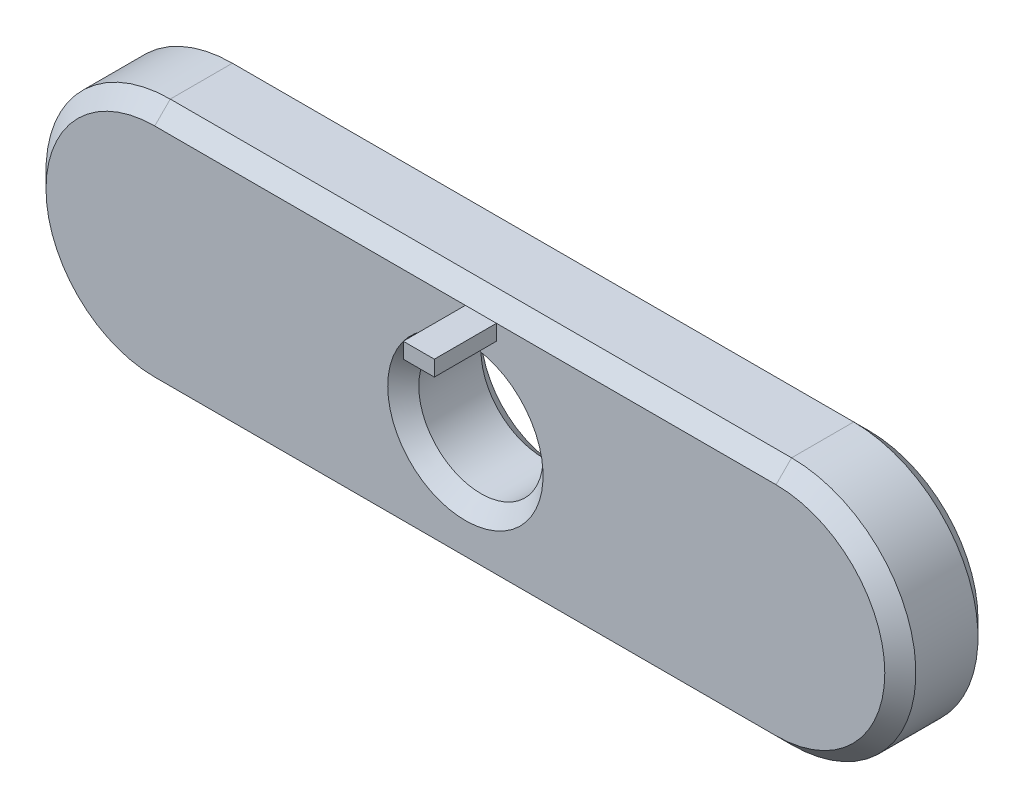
ISO-10303-21;
HEADER;
FILE_DESCRIPTION(('STEP AP214'),'2;1');
FILE_NAME('part.step','',(''),(''),'','','');
FILE_SCHEMA(('AUTOMOTIVE_DESIGN { 1 0 10303 214 1 1 1 1 }'));
ENDSEC;
DATA;
#1=APPLICATION_CONTEXT('core data for automotive mechanical design processes');
#2=APPLICATION_PROTOCOL_DEFINITION('international standard','automotive_design',2000,#1);
#3=PRODUCT_CONTEXT('',#1,'mechanical');
#4=PRODUCT('Part','Part','',(#3));
#5=PRODUCT_RELATED_PRODUCT_CATEGORY('part','',(#4));
#6=PRODUCT_DEFINITION_FORMATION('','',#4);
#7=PRODUCT_DEFINITION_CONTEXT('part definition',#1,'design');
#8=PRODUCT_DEFINITION('design','',#6,#7);
#9=PRODUCT_DEFINITION_SHAPE('','',#8);
#10=(LENGTH_UNIT() NAMED_UNIT(*) SI_UNIT(.MILLI.,.METRE.));
#11=(NAMED_UNIT(*) PLANE_ANGLE_UNIT() SI_UNIT($,.RADIAN.));
#12=(NAMED_UNIT(*) SI_UNIT($,.STERADIAN.) SOLID_ANGLE_UNIT());
#13=UNCERTAINTY_MEASURE_WITH_UNIT(LENGTH_MEASURE(1.E-05),#10,'distance_accuracy_value','');
#14=(GEOMETRIC_REPRESENTATION_CONTEXT(3) GLOBAL_UNCERTAINTY_ASSIGNED_CONTEXT((#13)) GLOBAL_UNIT_ASSIGNED_CONTEXT((#10,
#11,#12)) REPRESENTATION_CONTEXT('',''));
#15=CARTESIAN_POINT('',(0.,0.,0.));
#16=DIRECTION('',(0.,0.,1.));
#17=DIRECTION('',(1.,0.,0.));
#18=AXIS2_PLACEMENT_3D('',#15,#16,#17);
#19=CARTESIAN_POINT('',(10.,0.,3.));
#20=DIRECTION('',(0.,0.,-1.));
#21=DIRECTION('',(-1.,0.,0.));
#22=AXIS2_PLACEMENT_3D('',#19,#20,#21);
#23=PLANE('',#22);
#24=CARTESIAN_POINT('',(0.,0.,3.));
#25=DIRECTION('',(0.,0.,-1.));
#26=DIRECTION('',(-1.,0.,0.));
#27=AXIS2_PLACEMENT_3D('',#24,#25,#26);
#28=CIRCLE('',#27,2.5);
#29=CARTESIAN_POINT('',(-2.5,0.,3.));
#30=VERTEX_POINT('',#29);
#31=EDGE_CURVE('E179',#30,#30,#28,.T.);
#32=ORIENTED_EDGE('',*,*,#31,.T.);
#33=EDGE_LOOP('',(#32));
#34=FACE_BOUND('',#33,.T.);
#35=DIRECTION('',(0.,-1.,0.));
#36=VECTOR('',#35,1.);
#37=CARTESIAN_POINT('',(0.,0.,3.));
#38=LINE('',#37,#36);
#39=CARTESIAN_POINT('',(0.,3.49999999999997,3.00000000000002));
#40=VERTEX_POINT('',#39);
#41=CARTESIAN_POINT('',(0.,3.,3.));
#42=VERTEX_POINT('',#41);
#43=EDGE_CURVE('E143',#40,#42,#38,.T.);
#44=ORIENTED_EDGE('',*,*,#43,.F.);
#45=DIRECTION('',(-1.,0.,0.));
#46=VECTOR('',#45,1.);
#47=CARTESIAN_POINT('',(-10.,3.5,3.));
#48=LINE('',#47,#46);
#49=CARTESIAN_POINT('',(-10.,3.5,3.));
#50=VERTEX_POINT('',#49);
#51=EDGE_CURVE('E192',#40,#50,#48,.T.);
#52=ORIENTED_EDGE('',*,*,#51,.T.);
#53=CARTESIAN_POINT('',(-10.,0.,3.));
#54=DIRECTION('',(0.,0.,-1.));
#55=DIRECTION('',(-1.,0.,0.));
#56=AXIS2_PLACEMENT_3D('',#53,#54,#55);
#57=CIRCLE('',#56,3.49999999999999);
#58=CARTESIAN_POINT('',(-10.,-3.49999999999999,3.));
#59=VERTEX_POINT('',#58);
#60=EDGE_CURVE('E195',#50,#59,#57,.F.);
#61=ORIENTED_EDGE('',*,*,#60,.T.);
#62=DIRECTION('',(1.,0.,0.));
#63=VECTOR('',#62,1.);
#64=CARTESIAN_POINT('',(10.,-3.49999999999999,3.));
#65=LINE('',#64,#63);
#66=CARTESIAN_POINT('',(10.,-3.5,3.));
#67=VERTEX_POINT('',#66);
#68=EDGE_CURVE('E197',#59,#67,#65,.T.);
#69=ORIENTED_EDGE('',*,*,#68,.T.);
#70=CARTESIAN_POINT('',(10.,0.,3.));
#71=DIRECTION('',(0.,0.,-1.));
#72=DIRECTION('',(-1.,0.,0.));
#73=AXIS2_PLACEMENT_3D('',#70,#71,#72);
#74=CIRCLE('',#73,3.5);
#75=CARTESIAN_POINT('',(10.,3.5,3.));
#76=VERTEX_POINT('',#75);
#77=EDGE_CURVE('E190',#67,#76,#74,.F.);
#78=ORIENTED_EDGE('',*,*,#77,.T.);
#79=CARTESIAN_POINT('',(1.,3.5,3.));
#80=VERTEX_POINT('',#79);
#81=EDGE_CURVE('E193',#76,#80,#48,.T.);
#82=ORIENTED_EDGE('',*,*,#81,.T.);
#83=DIRECTION('',(0.,1.,0.));
#84=VECTOR('',#83,1.);
#85=CARTESIAN_POINT('',(1.,0.,3.));
#86=LINE('',#85,#84);
#87=CARTESIAN_POINT('',(1.,3.,3.));
#88=VERTEX_POINT('',#87);
#89=EDGE_CURVE('E53',#88,#80,#86,.T.);
#90=ORIENTED_EDGE('',*,*,#89,.F.);
#91=DIRECTION('',(1.,0.,0.));
#92=VECTOR('',#91,1.);
#93=CARTESIAN_POINT('',(10.,3.,3.));
#94=LINE('',#93,#92);
#95=EDGE_CURVE('E48',#42,#88,#94,.T.);
#96=ORIENTED_EDGE('',*,*,#95,.F.);
#97=EDGE_LOOP('',(#44,#52,#61,#69,#78,#82,#90,#96));
#98=FACE_BOUND('',#97,.T.);
#99=ADVANCED_FACE('F33',(#34,#98),#23,.F.);
#100=CARTESIAN_POINT('',(10.,0.,3.));
#101=DIRECTION('',(0.,0.,-1.));
#102=DIRECTION('',(-1.,0.,0.));
#103=AXIS2_PLACEMENT_3D('',#100,#101,#102);
#104=CYLINDRICAL_SURFACE('',#103,4.);
#105=DIRECTION('',(0.,0.,-1.));
#106=VECTOR('',#105,1.);
#107=CARTESIAN_POINT('',(10.,4.,3.));
#108=LINE('',#107,#106);
#109=CARTESIAN_POINT('',(10.,4.,2.49999999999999));
#110=VERTEX_POINT('',#109);
#111=CARTESIAN_POINT('',(10.,4.,0.500000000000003));
#112=VERTEX_POINT('',#111);
#113=EDGE_CURVE('E176',#110,#112,#108,.T.);
#114=ORIENTED_EDGE('',*,*,#113,.F.);
#115=CARTESIAN_POINT('',(10.,0.,2.49999999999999));
#116=DIRECTION('',(0.,0.,-1.));
#117=DIRECTION('',(-1.,0.,0.));
#118=AXIS2_PLACEMENT_3D('',#115,#116,#117);
#119=CIRCLE('',#118,4.);
#120=CARTESIAN_POINT('',(10.,-4.,2.49999999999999));
#121=VERTEX_POINT('',#120);
#122=EDGE_CURVE('E216',#110,#121,#119,.T.);
#123=ORIENTED_EDGE('',*,*,#122,.T.);
#124=DIRECTION('',(0.,0.,-1.));
#125=VECTOR('',#124,1.);
#126=CARTESIAN_POINT('',(10.,-4.,3.));
#127=LINE('',#126,#125);
#128=CARTESIAN_POINT('',(10.,-4.,0.500000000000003));
#129=VERTEX_POINT('',#128);
#130=EDGE_CURVE('E175',#121,#129,#127,.T.);
#131=ORIENTED_EDGE('',*,*,#130,.T.);
#132=CARTESIAN_POINT('',(10.,0.,0.500000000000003));
#133=DIRECTION('',(0.,0.,-1.));
#134=DIRECTION('',(-1.,0.,0.));
#135=AXIS2_PLACEMENT_3D('',#132,#133,#134);
#136=CIRCLE('',#135,4.);
#137=EDGE_CURVE('E214',#129,#112,#136,.F.);
#138=ORIENTED_EDGE('',*,*,#137,.T.);
#139=EDGE_LOOP('',(#114,#123,#131,#138));
#140=FACE_BOUND('',#139,.T.);
#141=ADVANCED_FACE('F35',(#140),#104,.T.);
#142=CARTESIAN_POINT('',(-10.,4.,3.));
#143=DIRECTION('',(0.,1.,0.));
#144=DIRECTION('',(0.,0.,1.));
#145=AXIS2_PLACEMENT_3D('',#142,#143,#144);
#146=PLANE('',#145);
#147=DIRECTION('',(0.,0.,-1.));
#148=VECTOR('',#147,1.);
#149=CARTESIAN_POINT('',(-10.,4.,3.));
#150=LINE('',#149,#148);
#151=CARTESIAN_POINT('',(-10.,4.,2.49999999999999));
#152=VERTEX_POINT('',#151);
#153=CARTESIAN_POINT('',(-10.,4.,0.500000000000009));
#154=VERTEX_POINT('',#153);
#155=EDGE_CURVE('E180',#152,#154,#150,.T.);
#156=ORIENTED_EDGE('',*,*,#155,.F.);
#157=DIRECTION('',(1.,0.,0.));
#158=VECTOR('',#157,1.);
#159=CARTESIAN_POINT('',(10.,4.,2.49999999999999));
#160=LINE('',#159,#158);
#161=EDGE_CURVE('E212',#152,#110,#160,.T.);
#162=ORIENTED_EDGE('',*,*,#161,.T.);
#163=ORIENTED_EDGE('',*,*,#113,.T.);
#164=DIRECTION('',(-1.,0.,0.));
#165=VECTOR('',#164,1.);
#166=CARTESIAN_POINT('',(-10.,4.,0.500000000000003));
#167=LINE('',#166,#165);
#168=EDGE_CURVE('E209',#112,#154,#167,.T.);
#169=ORIENTED_EDGE('',*,*,#168,.T.);
#170=EDGE_LOOP('',(#156,#162,#163,#169));
#171=FACE_BOUND('',#170,.T.);
#172=ADVANCED_FACE('F276',(#171),#146,.T.);
#173=CARTESIAN_POINT('',(-10.,0.,3.));
#174=DIRECTION('',(0.,0.,-1.));
#175=DIRECTION('',(-1.,0.,0.));
#176=AXIS2_PLACEMENT_3D('',#173,#174,#175);
#177=CYLINDRICAL_SURFACE('',#176,4.);
#178=DIRECTION('',(0.,0.,-1.));
#179=VECTOR('',#178,1.);
#180=CARTESIAN_POINT('',(-10.,-4.,3.));
#181=LINE('',#180,#179);
#182=CARTESIAN_POINT('',(-10.,-4.,2.5));
#183=VERTEX_POINT('',#182);
#184=CARTESIAN_POINT('',(-10.,-4.,0.500000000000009));
#185=VERTEX_POINT('',#184);
#186=EDGE_CURVE('E183',#183,#185,#181,.T.);
#187=ORIENTED_EDGE('',*,*,#186,.F.);
#188=CARTESIAN_POINT('',(-10.,0.,2.5));
#189=DIRECTION('',(0.,0.,-1.));
#190=DIRECTION('',(-1.,0.,0.));
#191=AXIS2_PLACEMENT_3D('',#188,#189,#190);
#192=CIRCLE('',#191,4.);
#193=EDGE_CURVE('E207',#183,#152,#192,.T.);
#194=ORIENTED_EDGE('',*,*,#193,.T.);
#195=ORIENTED_EDGE('',*,*,#155,.T.);
#196=CARTESIAN_POINT('',(-10.,0.,0.500000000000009));
#197=DIRECTION('',(0.,0.,-1.));
#198=DIRECTION('',(-1.,0.,0.));
#199=AXIS2_PLACEMENT_3D('',#196,#197,#198);
#200=CIRCLE('',#199,4.);
#201=EDGE_CURVE('E205',#154,#185,#200,.F.);
#202=ORIENTED_EDGE('',*,*,#201,.T.);
#203=EDGE_LOOP('',(#187,#194,#195,#202));
#204=FACE_BOUND('',#203,.T.);
#205=ADVANCED_FACE('F272',(#204),#177,.T.);
#206=CARTESIAN_POINT('',(-10.,-4.,3.));
#207=DIRECTION('',(0.,1.,0.));
#208=DIRECTION('',(-1.,0.,0.));
#209=AXIS2_PLACEMENT_3D('',#206,#207,#208);
#210=PLANE('',#209);
#211=ORIENTED_EDGE('',*,*,#130,.F.);
#212=DIRECTION('',(-1.,0.,0.));
#213=VECTOR('',#212,1.);
#214=CARTESIAN_POINT('',(-10.,-4.,2.5));
#215=LINE('',#214,#213);
#216=EDGE_CURVE('E202',#121,#183,#215,.T.);
#217=ORIENTED_EDGE('',*,*,#216,.T.);
#218=ORIENTED_EDGE('',*,*,#186,.T.);
#219=DIRECTION('',(1.,0.,0.));
#220=VECTOR('',#219,1.);
#221=CARTESIAN_POINT('',(10.,-4.,0.500000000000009));
#222=LINE('',#221,#220);
#223=EDGE_CURVE('E200',#185,#129,#222,.T.);
#224=ORIENTED_EDGE('',*,*,#223,.T.);
#225=EDGE_LOOP('',(#211,#217,#218,#224));
#226=FACE_BOUND('',#225,.T.);
#227=ADVANCED_FACE('F255',(#226),#210,.F.);
#228=CARTESIAN_POINT('',(10.,0.,0.));
#229=DIRECTION('',(0.,0.,-1.));
#230=DIRECTION('',(-1.,0.,0.));
#231=AXIS2_PLACEMENT_3D('',#228,#229,#230);
#232=PLANE('',#231);
#233=DIRECTION('',(1.,0.,0.));
#234=VECTOR('',#233,1.);
#235=CARTESIAN_POINT('',(10.,3.49999999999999,0.));
#236=LINE('',#235,#234);
#237=CARTESIAN_POINT('',(-10.,3.5,0.));
#238=VERTEX_POINT('',#237);
#239=CARTESIAN_POINT('',(10.,3.49999999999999,0.));
#240=VERTEX_POINT('',#239);
#241=EDGE_CURVE('E11',#238,#240,#236,.T.);
#242=ORIENTED_EDGE('',*,*,#241,.T.);
#243=CARTESIAN_POINT('',(10.,0.,0.));
#244=DIRECTION('',(0.,0.,-1.));
#245=DIRECTION('',(-1.,0.,0.));
#246=AXIS2_PLACEMENT_3D('',#243,#244,#245);
#247=CIRCLE('',#246,3.49999999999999);
#248=CARTESIAN_POINT('',(10.,-3.49999999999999,0.));
#249=VERTEX_POINT('',#248);
#250=EDGE_CURVE('E227',#240,#249,#247,.T.);
#251=ORIENTED_EDGE('',*,*,#250,.T.);
#252=DIRECTION('',(-1.,0.,0.));
#253=VECTOR('',#252,1.);
#254=CARTESIAN_POINT('',(-10.,-3.5,0.));
#255=LINE('',#254,#253);
#256=CARTESIAN_POINT('',(-10.,-3.5,0.));
#257=VERTEX_POINT('',#256);
#258=EDGE_CURVE('E229',#249,#257,#255,.T.);
#259=ORIENTED_EDGE('',*,*,#258,.T.);
#260=CARTESIAN_POINT('',(-10.,0.,0.));
#261=DIRECTION('',(0.,0.,-1.));
#262=DIRECTION('',(-1.,0.,0.));
#263=AXIS2_PLACEMENT_3D('',#260,#261,#262);
#264=CIRCLE('',#263,3.5);
#265=EDGE_CURVE('E41',#257,#238,#264,.T.);
#266=ORIENTED_EDGE('',*,*,#265,.T.);
#267=EDGE_LOOP('',(#242,#251,#259,#266));
#268=FACE_BOUND('',#267,.T.);
#269=CARTESIAN_POINT('',(0.,0.,0.));
#270=DIRECTION('',(0.,0.,-1.));
#271=DIRECTION('',(-1.,0.,0.));
#272=AXIS2_PLACEMENT_3D('',#269,#270,#271);
#273=CIRCLE('',#272,2.50000000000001);
#274=CARTESIAN_POINT('',(-2.50000000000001,0.,0.));
#275=VERTEX_POINT('',#274);
#276=EDGE_CURVE('E224',#275,#275,#273,.F.);
#277=ORIENTED_EDGE('',*,*,#276,.T.);
#278=EDGE_LOOP('',(#277));
#279=FACE_BOUND('',#278,.T.);
#280=ADVANCED_FACE('F233',(#268,#279),#232,.T.);
#281=CARTESIAN_POINT('',(0.,0.,0.));
#282=DIRECTION('',(0.,0.,1.));
#283=DIRECTION('',(1.,0.,0.));
#284=AXIS2_PLACEMENT_3D('',#281,#282,#283);
#285=CYLINDRICAL_SURFACE('',#284,2.);
#286=CARTESIAN_POINT('',(0.,0.,2.49999999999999));
#287=DIRECTION('',(0.,0.,-1.));
#288=DIRECTION('',(-1.,0.,0.));
#289=AXIS2_PLACEMENT_3D('',#286,#287,#288);
#290=CIRCLE('',#289,2.);
#291=CARTESIAN_POINT('',(-2.,0.,2.49999999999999));
#292=VERTEX_POINT('',#291);
#293=EDGE_CURVE('E221',#292,#292,#290,.F.);
#294=ORIENTED_EDGE('',*,*,#293,.T.);
#295=EDGE_LOOP('',(#294));
#296=FACE_BOUND('',#295,.T.);
#297=CARTESIAN_POINT('',(0.,0.,0.500000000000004));
#298=DIRECTION('',(0.,0.,-1.));
#299=DIRECTION('',(-1.,0.,0.));
#300=AXIS2_PLACEMENT_3D('',#297,#298,#299);
#301=CIRCLE('',#300,2.);
#302=CARTESIAN_POINT('',(-2.,0.,0.500000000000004));
#303=VERTEX_POINT('',#302);
#304=EDGE_CURVE('E218',#303,#303,#301,.T.);
#305=ORIENTED_EDGE('',*,*,#304,.T.);
#306=EDGE_LOOP('',(#305));
#307=FACE_BOUND('',#306,.T.);
#308=ADVANCED_FACE('F319',(#296,#307),#285,.F.);
#309=CARTESIAN_POINT('',(-10.,4.,2.49999999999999));
#310=DIRECTION('',(0.,0.707106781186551,0.707106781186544));
#311=DIRECTION('',(0.,-0.707106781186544,0.707106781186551));
#312=AXIS2_PLACEMENT_3D('',#309,#310,#311);
#313=PLANE('',#312);
#314=DIRECTION('',(0.,-0.707106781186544,0.707106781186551));
#315=VECTOR('',#314,1.);
#316=CARTESIAN_POINT('',(10.,4.,2.49999999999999));
#317=LINE('',#316,#315);
#318=EDGE_CURVE('E169',#110,#76,#317,.T.);
#319=ORIENTED_EDGE('',*,*,#318,.F.);
#320=ORIENTED_EDGE('',*,*,#161,.F.);
#321=DIRECTION('',(0.,0.707106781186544,-0.707106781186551));
#322=VECTOR('',#321,1.);
#323=CARTESIAN_POINT('',(-10.,3.5,3.));
#324=LINE('',#323,#322);
#325=EDGE_CURVE('E172',#50,#152,#324,.T.);
#326=ORIENTED_EDGE('',*,*,#325,.F.);
#327=ORIENTED_EDGE('',*,*,#51,.F.);
#328=DIRECTION('',(1.,0.,0.));
#329=VECTOR('',#328,1.);
#330=CARTESIAN_POINT('',(-10.,3.49999999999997,3.00000000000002));
#331=LINE('',#330,#329);
#332=EDGE_CURVE('E144',#40,#80,#331,.T.);
#333=ORIENTED_EDGE('',*,*,#332,.T.);
#334=ORIENTED_EDGE('',*,*,#81,.F.);
#335=EDGE_LOOP('',(#319,#320,#326,#327,#333,#334));
#336=FACE_BOUND('',#335,.T.);
#337=ADVANCED_FACE('F279',(#336),#313,.T.);
#338=CARTESIAN_POINT('',(-10.,0.,3.));
#339=DIRECTION('',(0.,0.,-1.));
#340=DIRECTION('',(-1.,0.,0.));
#341=AXIS2_PLACEMENT_3D('',#338,#339,#340);
#342=CONICAL_SURFACE('',#341,3.49999999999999,0.785398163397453);
#343=ORIENTED_EDGE('',*,*,#325,.T.);
#344=ORIENTED_EDGE('',*,*,#193,.F.);
#345=DIRECTION('',(0.,-0.707106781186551,-0.707106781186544));
#346=VECTOR('',#345,1.);
#347=CARTESIAN_POINT('',(-10.,-3.49999999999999,3.));
#348=LINE('',#347,#346);
#349=EDGE_CURVE('E167',#59,#183,#348,.T.);
#350=ORIENTED_EDGE('',*,*,#349,.F.);
#351=ORIENTED_EDGE('',*,*,#60,.F.);
#352=EDGE_LOOP('',(#343,#344,#350,#351));
#353=FACE_BOUND('',#352,.T.);
#354=ADVANCED_FACE('F283',(#353),#342,.T.);
#355=CARTESIAN_POINT('',(10.,0.,2.49999999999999));
#356=DIRECTION('',(0.,0.,-1.));
#357=DIRECTION('',(-1.,0.,0.));
#358=AXIS2_PLACEMENT_3D('',#355,#356,#357);
#359=CONICAL_SURFACE('',#358,4.,0.785398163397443);
#360=ORIENTED_EDGE('',*,*,#318,.T.);
#361=ORIENTED_EDGE('',*,*,#77,.F.);
#362=DIRECTION('',(0.,0.707106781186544,0.707106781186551));
#363=VECTOR('',#362,1.);
#364=CARTESIAN_POINT('',(10.,-4.,2.49999999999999));
#365=LINE('',#364,#363);
#366=EDGE_CURVE('E165',#121,#67,#365,.T.);
#367=ORIENTED_EDGE('',*,*,#366,.F.);
#368=ORIENTED_EDGE('',*,*,#122,.F.);
#369=EDGE_LOOP('',(#360,#361,#367,#368));
#370=FACE_BOUND('',#369,.T.);
#371=ADVANCED_FACE('F264',(#370),#359,.T.);
#372=CARTESIAN_POINT('',(10.,-3.49999999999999,3.));
#373=DIRECTION('',(0.,0.707106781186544,-0.707106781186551));
#374=DIRECTION('',(0.,0.707106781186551,0.707106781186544));
#375=AXIS2_PLACEMENT_3D('',#372,#373,#374);
#376=PLANE('',#375);
#377=ORIENTED_EDGE('',*,*,#349,.T.);
#378=ORIENTED_EDGE('',*,*,#216,.F.);
#379=ORIENTED_EDGE('',*,*,#366,.T.);
#380=ORIENTED_EDGE('',*,*,#68,.F.);
#381=EDGE_LOOP('',(#377,#378,#379,#380));
#382=FACE_BOUND('',#381,.T.);
#383=ADVANCED_FACE('F268',(#382),#376,.F.);
#384=CARTESIAN_POINT('',(0.,0.,2.49999999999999));
#385=DIRECTION('',(0.,0.,1.));
#386=DIRECTION('',(1.,0.,0.));
#387=AXIS2_PLACEMENT_3D('',#384,#385,#386);
#388=CONICAL_SURFACE('',#387,2.,0.785398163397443);
#389=ORIENTED_EDGE('',*,*,#31,.F.);
#390=EDGE_LOOP('',(#389));
#391=FACE_BOUND('',#390,.T.);
#392=ORIENTED_EDGE('',*,*,#293,.F.);
#393=EDGE_LOOP('',(#392));
#394=FACE_BOUND('',#393,.T.);
#395=ADVANCED_FACE('F336',(#391,#394),#388,.F.);
#396=CARTESIAN_POINT('',(-10.,-4.,0.500000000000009));
#397=DIRECTION('',(0.,-0.707106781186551,-0.707106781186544));
#398=DIRECTION('',(0.,0.707106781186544,-0.707106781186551));
#399=AXIS2_PLACEMENT_3D('',#396,#397,#398);
#400=PLANE('',#399);
#401=DIRECTION('',(0.,0.707106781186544,-0.707106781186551));
#402=VECTOR('',#401,1.);
#403=CARTESIAN_POINT('',(10.,-4.,0.500000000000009));
#404=LINE('',#403,#402);
#405=EDGE_CURVE('E159',#129,#249,#404,.T.);
#406=ORIENTED_EDGE('',*,*,#405,.F.);
#407=ORIENTED_EDGE('',*,*,#223,.F.);
#408=DIRECTION('',(0.,-0.707106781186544,0.707106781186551));
#409=VECTOR('',#408,1.);
#410=CARTESIAN_POINT('',(-10.,-3.5,0.));
#411=LINE('',#410,#409);
#412=EDGE_CURVE('E162',#257,#185,#411,.T.);
#413=ORIENTED_EDGE('',*,*,#412,.F.);
#414=ORIENTED_EDGE('',*,*,#258,.F.);
#415=EDGE_LOOP('',(#406,#407,#413,#414));
#416=FACE_BOUND('',#415,.T.);
#417=ADVANCED_FACE('F251',(#416),#400,.T.);
#418=CARTESIAN_POINT('',(-10.,0.,0.500000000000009));
#419=DIRECTION('',(0.,0.,1.));
#420=DIRECTION('',(1.,0.,0.));
#421=AXIS2_PLACEMENT_3D('',#418,#419,#420);
#422=CONICAL_SURFACE('',#421,4.,0.785398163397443);
#423=ORIENTED_EDGE('',*,*,#412,.T.);
#424=ORIENTED_EDGE('',*,*,#201,.F.);
#425=DIRECTION('',(0.,0.707106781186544,0.707106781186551));
#426=VECTOR('',#425,1.);
#427=CARTESIAN_POINT('',(-10.,3.5,0.));
#428=LINE('',#427,#426);
#429=EDGE_CURVE('E157',#238,#154,#428,.T.);
#430=ORIENTED_EDGE('',*,*,#429,.F.);
#431=ORIENTED_EDGE('',*,*,#265,.F.);
#432=EDGE_LOOP('',(#423,#424,#430,#431));
#433=FACE_BOUND('',#432,.T.);
#434=ADVANCED_FACE('F240',(#433),#422,.T.);
#435=CARTESIAN_POINT('',(10.,0.,0.));
#436=DIRECTION('',(0.,0.,1.));
#437=DIRECTION('',(1.,0.,0.));
#438=AXIS2_PLACEMENT_3D('',#435,#436,#437);
#439=CONICAL_SURFACE('',#438,3.49999999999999,0.785398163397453);
#440=ORIENTED_EDGE('',*,*,#405,.T.);
#441=ORIENTED_EDGE('',*,*,#250,.F.);
#442=DIRECTION('',(0.,-0.707106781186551,-0.707106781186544));
#443=VECTOR('',#442,1.);
#444=CARTESIAN_POINT('',(10.,4.,0.500000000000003));
#445=LINE('',#444,#443);
#446=EDGE_CURVE('E154',#112,#240,#445,.T.);
#447=ORIENTED_EDGE('',*,*,#446,.F.);
#448=ORIENTED_EDGE('',*,*,#137,.F.);
#449=EDGE_LOOP('',(#440,#441,#447,#448));
#450=FACE_BOUND('',#449,.T.);
#451=ADVANCED_FACE('F248',(#450),#439,.T.);
#452=CARTESIAN_POINT('',(10.,3.49999999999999,0.));
#453=DIRECTION('',(0.,-0.707106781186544,0.707106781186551));
#454=DIRECTION('',(0.,-0.707106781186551,-0.707106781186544));
#455=AXIS2_PLACEMENT_3D('',#452,#453,#454);
#456=PLANE('',#455);
#457=ORIENTED_EDGE('',*,*,#429,.T.);
#458=ORIENTED_EDGE('',*,*,#168,.F.);
#459=ORIENTED_EDGE('',*,*,#446,.T.);
#460=ORIENTED_EDGE('',*,*,#241,.F.);
#461=EDGE_LOOP('',(#457,#458,#459,#460));
#462=FACE_BOUND('',#461,.T.);
#463=ADVANCED_FACE('F243',(#462),#456,.F.);
#464=CARTESIAN_POINT('',(0.,0.,0.));
#465=DIRECTION('',(0.,0.,-1.));
#466=DIRECTION('',(-1.,0.,0.));
#467=AXIS2_PLACEMENT_3D('',#464,#465,#466);
#468=CONICAL_SURFACE('',#467,2.50000000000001,0.785398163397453);
#469=ORIENTED_EDGE('',*,*,#304,.F.);
#470=EDGE_LOOP('',(#469));
#471=FACE_BOUND('',#470,.T.);
#472=ORIENTED_EDGE('',*,*,#276,.F.);
#473=EDGE_LOOP('',(#472));
#474=FACE_BOUND('',#473,.T.);
#475=ADVANCED_FACE('F348',(#471,#474),#468,.F.);
#476=CARTESIAN_POINT('',(0.,3.49999999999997,5.));
#477=DIRECTION('',(1.,0.,0.));
#478=DIRECTION('',(0.,0.,-1.));
#479=AXIS2_PLACEMENT_3D('',#476,#477,#478);
#480=PLANE('',#479);
#481=DIRECTION('',(0.,0.,-1.));
#482=VECTOR('',#481,1.);
#483=CARTESIAN_POINT('',(0.,3.49999999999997,5.));
#484=LINE('',#483,#482);
#485=CARTESIAN_POINT('',(0.,3.49999999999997,5.));
#486=VERTEX_POINT('',#485);
#487=EDGE_CURVE('E291',#486,#40,#484,.T.);
#488=ORIENTED_EDGE('',*,*,#487,.T.);
#489=ORIENTED_EDGE('',*,*,#43,.T.);
#490=DIRECTION('',(0.,0.,-1.));
#491=VECTOR('',#490,1.);
#492=CARTESIAN_POINT('',(0.,3.,5.));
#493=LINE('',#492,#491);
#494=CARTESIAN_POINT('',(0.,3.,5.));
#495=VERTEX_POINT('',#494);
#496=EDGE_CURVE('E126',#495,#42,#493,.T.);
#497=ORIENTED_EDGE('',*,*,#496,.F.);
#498=DIRECTION('',(0.,-1.,0.));
#499=VECTOR('',#498,1.);
#500=CARTESIAN_POINT('',(0.,3.49999999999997,5.));
#501=LINE('',#500,#499);
#502=EDGE_CURVE('E132',#486,#495,#501,.T.);
#503=ORIENTED_EDGE('',*,*,#502,.F.);
#504=EDGE_LOOP('',(#488,#489,#497,#503));
#505=FACE_BOUND('',#504,.T.);
#506=ADVANCED_FACE('F142',(#505),#480,.F.);
#507=CARTESIAN_POINT('',(0.,3.,5.));
#508=DIRECTION('',(0.,1.,0.));
#509=DIRECTION('',(0.,0.,1.));
#510=AXIS2_PLACEMENT_3D('',#507,#508,#509);
#511=PLANE('',#510);
#512=ORIENTED_EDGE('',*,*,#496,.T.);
#513=ORIENTED_EDGE('',*,*,#95,.T.);
#514=DIRECTION('',(0.,0.,-1.));
#515=VECTOR('',#514,1.);
#516=CARTESIAN_POINT('',(1.,3.,5.));
#517=LINE('',#516,#515);
#518=CARTESIAN_POINT('',(1.,3.,5.));
#519=VERTEX_POINT('',#518);
#520=EDGE_CURVE('E128',#519,#88,#517,.T.);
#521=ORIENTED_EDGE('',*,*,#520,.F.);
#522=DIRECTION('',(1.,0.,0.));
#523=VECTOR('',#522,1.);
#524=CARTESIAN_POINT('',(0.,3.,5.));
#525=LINE('',#524,#523);
#526=EDGE_CURVE('E122',#495,#519,#525,.T.);
#527=ORIENTED_EDGE('',*,*,#526,.F.);
#528=EDGE_LOOP('',(#512,#513,#521,#527));
#529=FACE_BOUND('',#528,.T.);
#530=ADVANCED_FACE('F124',(#529),#511,.F.);
#531=CARTESIAN_POINT('',(1.,3.49999999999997,5.));
#532=DIRECTION('',(-1.,0.,0.));
#533=DIRECTION('',(0.,0.,1.));
#534=AXIS2_PLACEMENT_3D('',#531,#532,#533);
#535=PLANE('',#534);
#536=ORIENTED_EDGE('',*,*,#520,.T.);
#537=ORIENTED_EDGE('',*,*,#89,.T.);
#538=DIRECTION('',(0.,0.,-1.));
#539=VECTOR('',#538,1.);
#540=CARTESIAN_POINT('',(1.,3.49999999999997,5.));
#541=LINE('',#540,#539);
#542=CARTESIAN_POINT('',(1.,3.49999999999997,5.));
#543=VERTEX_POINT('',#542);
#544=EDGE_CURVE('E147',#543,#80,#541,.T.);
#545=ORIENTED_EDGE('',*,*,#544,.F.);
#546=DIRECTION('',(0.,1.,0.));
#547=VECTOR('',#546,1.);
#548=CARTESIAN_POINT('',(1.,3.49999999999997,5.));
#549=LINE('',#548,#547);
#550=EDGE_CURVE('E131',#519,#543,#549,.T.);
#551=ORIENTED_EDGE('',*,*,#550,.F.);
#552=EDGE_LOOP('',(#536,#537,#545,#551));
#553=FACE_BOUND('',#552,.T.);
#554=ADVANCED_FACE('F289',(#553),#535,.F.);
#555=CARTESIAN_POINT('',(0.,3.49999999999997,5.));
#556=DIRECTION('',(0.,-1.,0.));
#557=DIRECTION('',(0.,0.,-1.));
#558=AXIS2_PLACEMENT_3D('',#555,#556,#557);
#559=PLANE('',#558);
#560=ORIENTED_EDGE('',*,*,#332,.F.);
#561=ORIENTED_EDGE('',*,*,#487,.F.);
#562=DIRECTION('',(-1.,0.,0.));
#563=VECTOR('',#562,1.);
#564=CARTESIAN_POINT('',(0.,3.49999999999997,5.));
#565=LINE('',#564,#563);
#566=EDGE_CURVE('E137',#543,#486,#565,.T.);
#567=ORIENTED_EDGE('',*,*,#566,.F.);
#568=ORIENTED_EDGE('',*,*,#544,.T.);
#569=EDGE_LOOP('',(#560,#561,#567,#568));
#570=FACE_BOUND('',#569,.T.);
#571=ADVANCED_FACE('F290',(#570),#559,.F.);
#572=CARTESIAN_POINT('',(0.,3.,5.));
#573=DIRECTION('',(0.,0.,1.));
#574=DIRECTION('',(1.,0.,0.));
#575=AXIS2_PLACEMENT_3D('',#572,#573,#574);
#576=PLANE('',#575);
#577=ORIENTED_EDGE('',*,*,#502,.T.);
#578=ORIENTED_EDGE('',*,*,#526,.T.);
#579=ORIENTED_EDGE('',*,*,#550,.T.);
#580=ORIENTED_EDGE('',*,*,#566,.T.);
#581=EDGE_LOOP('',(#577,#578,#579,#580));
#582=FACE_BOUND('',#581,.T.);
#583=ADVANCED_FACE('F135',(#582),#576,.T.);
#584=CLOSED_SHELL('',(#99,#141,#172,#205,#227,#280,#308,#337,#354,#371,#383,#395,#417,#434,#451,
#463,#475,#506,#530,#554,#571,#583));
#585=MANIFOLD_SOLID_BREP('B2',#584);
#586=ADVANCED_BREP_SHAPE_REPRESENTATION('',(#18,#585),#14);
#587=SHAPE_DEFINITION_REPRESENTATION(#9,#586);
ENDSEC;
END-ISO-10303-21;
